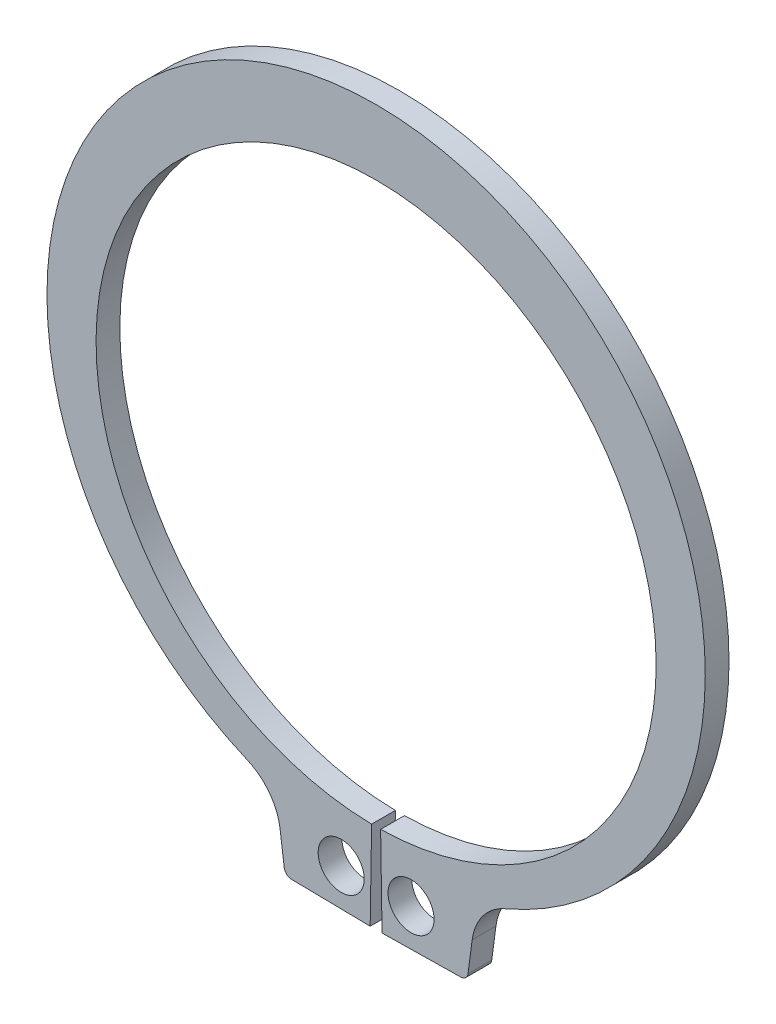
ISO-10303-21;
HEADER;
FILE_DESCRIPTION(('STEP AP214'),'2;1');
FILE_NAME('part.step','',(''),(''),'','','');
FILE_SCHEMA(('AUTOMOTIVE_DESIGN { 1 0 10303 214 1 1 1 1 }'));
ENDSEC;
DATA;
#1=APPLICATION_CONTEXT('core data for automotive mechanical design processes');
#2=APPLICATION_PROTOCOL_DEFINITION('international standard','automotive_design',2000,#1);
#3=PRODUCT_CONTEXT('',#1,'mechanical');
#4=PRODUCT('Part','Part','',(#3));
#5=PRODUCT_RELATED_PRODUCT_CATEGORY('part','',(#4));
#6=PRODUCT_DEFINITION_FORMATION('','',#4);
#7=PRODUCT_DEFINITION_CONTEXT('part definition',#1,'design');
#8=PRODUCT_DEFINITION('design','',#6,#7);
#9=PRODUCT_DEFINITION_SHAPE('','',#8);
#10=(LENGTH_UNIT() NAMED_UNIT(*) SI_UNIT(.MILLI.,.METRE.));
#11=(NAMED_UNIT(*) PLANE_ANGLE_UNIT() SI_UNIT($,.RADIAN.));
#12=(NAMED_UNIT(*) SI_UNIT($,.STERADIAN.) SOLID_ANGLE_UNIT());
#13=UNCERTAINTY_MEASURE_WITH_UNIT(LENGTH_MEASURE(1.E-05),#10,'distance_accuracy_value','');
#14=(GEOMETRIC_REPRESENTATION_CONTEXT(3) GLOBAL_UNCERTAINTY_ASSIGNED_CONTEXT((#13)) GLOBAL_UNIT_ASSIGNED_CONTEXT((#10,
#11,#12)) REPRESENTATION_CONTEXT('',''));
#15=CARTESIAN_POINT('',(0.,0.,0.));
#16=DIRECTION('',(0.,0.,1.));
#17=DIRECTION('',(1.,0.,0.));
#18=AXIS2_PLACEMENT_3D('',#15,#16,#17);
#19=CARTESIAN_POINT('',(0.,0.,-0.8));
#20=DIRECTION('',(0.,0.,1.));
#21=DIRECTION('',(1.,0.,0.));
#22=AXIS2_PLACEMENT_3D('',#19,#20,#21);
#23=CYLINDRICAL_SURFACE('',#22,18.85);
#24=CARTESIAN_POINT('',(0.,0.,0.8));
#25=DIRECTION('',(0.,0.,-1.));
#26=DIRECTION('',(1.,0.,0.));
#27=AXIS2_PLACEMENT_3D('',#24,#25,#26);
#28=CIRCLE('',#27,18.85);
#29=CARTESIAN_POINT('',(-0.303420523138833,-18.8475578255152,0.8));
#30=VERTEX_POINT('',#29);
#31=CARTESIAN_POINT('',(0.303420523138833,-18.8475578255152,0.8));
#32=VERTEX_POINT('',#31);
#33=EDGE_CURVE('E116',#30,#32,#28,.T.);
#34=ORIENTED_EDGE('',*,*,#33,.F.);
#35=DIRECTION('',(0.,0.,1.));
#36=VECTOR('',#35,1.);
#37=CARTESIAN_POINT('',(-0.303420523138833,-18.8475578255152,-0.8));
#38=LINE('',#37,#36);
#39=CARTESIAN_POINT('',(-0.303420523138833,-18.8475578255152,-0.8));
#40=VERTEX_POINT('',#39);
#41=EDGE_CURVE('E11',#40,#30,#38,.T.);
#42=ORIENTED_EDGE('',*,*,#41,.F.);
#43=CARTESIAN_POINT('',(0.,0.,-0.8));
#44=DIRECTION('',(0.,0.,-1.));
#45=DIRECTION('',(1.,0.,0.));
#46=AXIS2_PLACEMENT_3D('',#43,#44,#45);
#47=CIRCLE('',#46,18.85);
#48=CARTESIAN_POINT('',(0.303420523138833,-18.8475578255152,-0.8));
#49=VERTEX_POINT('',#48);
#50=EDGE_CURVE('E118',#40,#49,#47,.T.);
#51=ORIENTED_EDGE('',*,*,#50,.T.);
#52=DIRECTION('',(0.,0.,1.));
#53=VECTOR('',#52,1.);
#54=CARTESIAN_POINT('',(0.303420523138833,-18.8475578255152,-0.8));
#55=LINE('',#54,#53);
#56=EDGE_CURVE('E31',#49,#32,#55,.T.);
#57=ORIENTED_EDGE('',*,*,#56,.T.);
#58=EDGE_LOOP('',(#34,#42,#51,#57));
#59=FACE_BOUND('',#58,.T.);
#60=ADVANCED_FACE('F28',(#59),#23,.F.);
#61=CARTESIAN_POINT('',(-0.303420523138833,-18.8475578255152,-0.8));
#62=DIRECTION('',(0.999870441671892,-0.0160965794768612,0.));
#63=DIRECTION('',(0.0160965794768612,0.999870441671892,0.));
#64=AXIS2_PLACEMENT_3D('',#61,#62,#63);
#65=PLANE('',#64);
#66=DIRECTION('',(0.0160965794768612,0.999870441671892,0.));
#67=VECTOR('',#66,1.);
#68=CARTESIAN_POINT('',(-0.303420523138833,-18.8475578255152,0.8));
#69=LINE('',#68,#67);
#70=CARTESIAN_POINT('',(-0.4,-24.8467804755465,0.8));
#71=VERTEX_POINT('',#70);
#72=EDGE_CURVE('E134',#71,#30,#69,.T.);
#73=ORIENTED_EDGE('',*,*,#72,.F.);
#74=DIRECTION('',(0.,0.,1.));
#75=VECTOR('',#74,1.);
#76=CARTESIAN_POINT('',(-0.4,-24.8467804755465,-0.8));
#77=LINE('',#76,#75);
#78=CARTESIAN_POINT('',(-0.4,-24.8467804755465,-0.8));
#79=VERTEX_POINT('',#78);
#80=EDGE_CURVE('E36',#79,#71,#77,.T.);
#81=ORIENTED_EDGE('',*,*,#80,.F.);
#82=DIRECTION('',(0.0160965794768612,0.999870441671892,0.));
#83=VECTOR('',#82,1.);
#84=CARTESIAN_POINT('',(-0.303420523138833,-18.8475578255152,-0.8));
#85=LINE('',#84,#83);
#86=EDGE_CURVE('E123',#79,#40,#85,.T.);
#87=ORIENTED_EDGE('',*,*,#86,.T.);
#88=ORIENTED_EDGE('',*,*,#41,.T.);
#89=EDGE_LOOP('',(#73,#81,#87,#88));
#90=FACE_BOUND('',#89,.T.);
#91=ADVANCED_FACE('F246',(#90),#65,.T.);
#92=CARTESIAN_POINT('',(-0.4,-24.8467804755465,-0.8));
#93=DIRECTION('',(-0.0160965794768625,-0.999870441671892,0.));
#94=DIRECTION('',(0.999870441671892,-0.0160965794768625,0.));
#95=AXIS2_PLACEMENT_3D('',#92,#93,#94);
#96=PLANE('',#95);
#97=DIRECTION('',(0.999870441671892,-0.0160965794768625,0.));
#98=VECTOR('',#97,1.);
#99=CARTESIAN_POINT('',(-0.4,-24.8467804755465,0.8));
#100=LINE('',#99,#98);
#101=CARTESIAN_POINT('',(-5.69728426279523,-24.7615012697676,0.8));
#102=VERTEX_POINT('',#101);
#103=EDGE_CURVE('E164',#102,#71,#100,.T.);
#104=ORIENTED_EDGE('',*,*,#103,.F.);
#105=DIRECTION('',(0.,0.,1.));
#106=VECTOR('',#105,1.);
#107=CARTESIAN_POINT('',(-5.69728426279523,-24.7615012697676,-0.8));
#108=LINE('',#107,#106);
#109=CARTESIAN_POINT('',(-5.69728426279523,-24.7615012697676,-0.8));
#110=VERTEX_POINT('',#109);
#111=EDGE_CURVE('E198',#110,#102,#108,.T.);
#112=ORIENTED_EDGE('',*,*,#111,.F.);
#113=DIRECTION('',(0.999870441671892,-0.0160965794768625,0.));
#114=VECTOR('',#113,1.);
#115=CARTESIAN_POINT('',(-0.4,-24.8467804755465,-0.8));
#116=LINE('',#115,#114);
#117=EDGE_CURVE('E194',#110,#79,#116,.T.);
#118=ORIENTED_EDGE('',*,*,#117,.T.);
#119=ORIENTED_EDGE('',*,*,#80,.T.);
#120=EDGE_LOOP('',(#104,#112,#118,#119));
#121=FACE_BOUND('',#120,.T.);
#122=ADVANCED_FACE('F251',(#121),#96,.T.);
#123=CARTESIAN_POINT('',(-5.6892359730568,-24.2615660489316,-0.8));
#124=DIRECTION('',(0.,0.,1.));
#125=DIRECTION('',(1.,0.,0.));
#126=AXIS2_PLACEMENT_3D('',#123,#124,#125);
#127=CYLINDRICAL_SURFACE('',#126,0.499999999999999);
#128=CARTESIAN_POINT('',(-5.6892359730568,-24.2615660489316,0.8));
#129=DIRECTION('',(0.,0.,1.));
#130=DIRECTION('',(1.,0.,0.));
#131=AXIS2_PLACEMENT_3D('',#128,#129,#130);
#132=CIRCLE('',#131,0.499999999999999);
#133=CARTESIAN_POINT('',(-6.1849584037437,-24.3268291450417,0.8));
#134=VERTEX_POINT('',#133);
#135=EDGE_CURVE('E161',#134,#102,#132,.T.);
#136=ORIENTED_EDGE('',*,*,#135,.F.);
#137=DIRECTION('',(0.,0.,1.));
#138=VECTOR('',#137,1.);
#139=CARTESIAN_POINT('',(-6.1849584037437,-24.3268291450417,-0.8));
#140=LINE('',#139,#138);
#141=CARTESIAN_POINT('',(-6.1849584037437,-24.3268291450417,-0.8));
#142=VERTEX_POINT('',#141);
#143=EDGE_CURVE('E200',#142,#134,#140,.T.);
#144=ORIENTED_EDGE('',*,*,#143,.F.);
#145=CARTESIAN_POINT('',(-5.6892359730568,-24.2615660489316,-0.8));
#146=DIRECTION('',(0.,0.,1.));
#147=DIRECTION('',(1.,0.,0.));
#148=AXIS2_PLACEMENT_3D('',#145,#146,#147);
#149=CIRCLE('',#148,0.499999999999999);
#150=EDGE_CURVE('E191',#142,#110,#149,.T.);
#151=ORIENTED_EDGE('',*,*,#150,.T.);
#152=ORIENTED_EDGE('',*,*,#111,.T.);
#153=EDGE_LOOP('',(#136,#144,#151,#152));
#154=FACE_BOUND('',#153,.T.);
#155=ADVANCED_FACE('F243',(#154),#127,.T.);
#156=CARTESIAN_POINT('',(-6.46391487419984,-22.2079443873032,-0.8));
#157=DIRECTION('',(-0.99144486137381,-0.130526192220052,0.));
#158=DIRECTION('',(0.130526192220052,-0.99144486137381,0.));
#159=AXIS2_PLACEMENT_3D('',#156,#157,#158);
#160=PLANE('',#159);
#161=DIRECTION('',(0.130526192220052,-0.99144486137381,0.));
#162=VECTOR('',#161,1.);
#163=CARTESIAN_POINT('',(-6.46391487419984,-22.2079443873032,0.8));
#164=LINE('',#163,#162);
#165=CARTESIAN_POINT('',(-6.46391487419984,-22.2079443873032,0.8));
#166=VERTEX_POINT('',#165);
#167=EDGE_CURVE('E158',#166,#134,#164,.T.);
#168=ORIENTED_EDGE('',*,*,#167,.F.);
#169=DIRECTION('',(0.,0.,1.));
#170=VECTOR('',#169,1.);
#171=CARTESIAN_POINT('',(-6.46391487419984,-22.2079443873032,-0.8));
#172=LINE('',#171,#170);
#173=CARTESIAN_POINT('',(-6.46391487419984,-22.2079443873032,-0.8));
#174=VERTEX_POINT('',#173);
#175=EDGE_CURVE('E202',#174,#166,#172,.T.);
#176=ORIENTED_EDGE('',*,*,#175,.F.);
#177=DIRECTION('',(0.130526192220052,-0.99144486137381,0.));
#178=VECTOR('',#177,1.);
#179=CARTESIAN_POINT('',(-6.46391487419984,-22.2079443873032,-0.8));
#180=LINE('',#179,#178);
#181=EDGE_CURVE('E188',#174,#142,#180,.T.);
#182=ORIENTED_EDGE('',*,*,#181,.T.);
#183=ORIENTED_EDGE('',*,*,#143,.T.);
#184=EDGE_LOOP('',(#168,#176,#182,#183));
#185=FACE_BOUND('',#184,.T.);
#186=ADVANCED_FACE('F239',(#185),#160,.T.);
#187=CARTESIAN_POINT('',(-10.1316221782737,-22.690807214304,-0.8));
#188=DIRECTION('',(0.,0.,1.));
#189=DIRECTION('',(1.,0.,0.));
#190=AXIS2_PLACEMENT_3D('',#187,#188,#189);
#191=CYLINDRICAL_SURFACE('',#190,3.69935580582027);
#192=CARTESIAN_POINT('',(-10.1316221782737,-22.690807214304,0.8));
#193=DIRECTION('',(0.,0.,-1.));
#194=DIRECTION('',(1.,0.,0.));
#195=AXIS2_PLACEMENT_3D('',#192,#193,#194);
#196=CIRCLE('',#195,3.69935580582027);
#197=CARTESIAN_POINT('',(-8.68192595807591,-19.2873363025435,0.8));
#198=VERTEX_POINT('',#197);
#199=EDGE_CURVE('E155',#198,#166,#196,.T.);
#200=ORIENTED_EDGE('',*,*,#199,.F.);
#201=DIRECTION('',(0.,0.,1.));
#202=VECTOR('',#201,1.);
#203=CARTESIAN_POINT('',(-8.68192595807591,-19.2873363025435,-0.8));
#204=LINE('',#203,#202);
#205=CARTESIAN_POINT('',(-8.68192595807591,-19.2873363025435,-0.8));
#206=VERTEX_POINT('',#205);
#207=EDGE_CURVE('E204',#206,#198,#204,.T.);
#208=ORIENTED_EDGE('',*,*,#207,.F.);
#209=CARTESIAN_POINT('',(-10.1316221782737,-22.690807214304,-0.8));
#210=DIRECTION('',(0.,0.,-1.));
#211=DIRECTION('',(1.,0.,0.));
#212=AXIS2_PLACEMENT_3D('',#209,#210,#211);
#213=CIRCLE('',#212,3.69935580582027);
#214=EDGE_CURVE('E185',#206,#174,#213,.T.);
#215=ORIENTED_EDGE('',*,*,#214,.T.);
#216=ORIENTED_EDGE('',*,*,#175,.T.);
#217=EDGE_LOOP('',(#200,#208,#215,#216));
#218=FACE_BOUND('',#217,.T.);
#219=ADVANCED_FACE('F235',(#218),#191,.F.);
#220=CARTESIAN_POINT('',(0.,1.09533562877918,-0.8));
#221=DIRECTION('',(0.,0.,1.));
#222=DIRECTION('',(1.,0.,0.));
#223=AXIS2_PLACEMENT_3D('',#220,#221,#222);
#224=CYLINDRICAL_SURFACE('',#223,22.1546643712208);
#225=CARTESIAN_POINT('',(0.,1.09533562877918,0.8));
#226=DIRECTION('',(0.,0.,1.));
#227=DIRECTION('',(1.,0.,0.));
#228=AXIS2_PLACEMENT_3D('',#225,#226,#227);
#229=CIRCLE('',#228,22.1546643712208);
#230=CARTESIAN_POINT('',(8.6819259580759,-19.2873363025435,0.8));
#231=VERTEX_POINT('',#230);
#232=EDGE_CURVE('E152',#231,#198,#229,.T.);
#233=ORIENTED_EDGE('',*,*,#232,.F.);
#234=DIRECTION('',(0.,0.,1.));
#235=VECTOR('',#234,1.);
#236=CARTESIAN_POINT('',(8.6819259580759,-19.2873363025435,-0.8));
#237=LINE('',#236,#235);
#238=CARTESIAN_POINT('',(8.6819259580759,-19.2873363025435,-0.8));
#239=VERTEX_POINT('',#238);
#240=EDGE_CURVE('E206',#239,#231,#237,.T.);
#241=ORIENTED_EDGE('',*,*,#240,.F.);
#242=CARTESIAN_POINT('',(0.,1.09533562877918,-0.8));
#243=DIRECTION('',(0.,0.,1.));
#244=DIRECTION('',(1.,0.,0.));
#245=AXIS2_PLACEMENT_3D('',#242,#243,#244);
#246=CIRCLE('',#245,22.1546643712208);
#247=EDGE_CURVE('E182',#239,#206,#246,.T.);
#248=ORIENTED_EDGE('',*,*,#247,.T.);
#249=ORIENTED_EDGE('',*,*,#207,.T.);
#250=EDGE_LOOP('',(#233,#241,#248,#249));
#251=FACE_BOUND('',#250,.T.);
#252=ADVANCED_FACE('F231',(#251),#224,.T.);
#253=CARTESIAN_POINT('',(10.1316221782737,-22.690807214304,-0.8));
#254=DIRECTION('',(0.,0.,1.));
#255=DIRECTION('',(1.,0.,0.));
#256=AXIS2_PLACEMENT_3D('',#253,#254,#255);
#257=CYLINDRICAL_SURFACE('',#256,3.69935580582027);
#258=CARTESIAN_POINT('',(10.1316221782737,-22.690807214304,0.8));
#259=DIRECTION('',(0.,0.,-1.));
#260=DIRECTION('',(1.,0.,0.));
#261=AXIS2_PLACEMENT_3D('',#258,#259,#260);
#262=CIRCLE('',#261,3.69935580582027);
#263=CARTESIAN_POINT('',(6.46391487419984,-22.2079443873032,0.8));
#264=VERTEX_POINT('',#263);
#265=EDGE_CURVE('E149',#264,#231,#262,.T.);
#266=ORIENTED_EDGE('',*,*,#265,.F.);
#267=DIRECTION('',(0.,0.,1.));
#268=VECTOR('',#267,1.);
#269=CARTESIAN_POINT('',(6.46391487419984,-22.2079443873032,-0.8));
#270=LINE('',#269,#268);
#271=CARTESIAN_POINT('',(6.46391487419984,-22.2079443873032,-0.8));
#272=VERTEX_POINT('',#271);
#273=EDGE_CURVE('E208',#272,#264,#270,.T.);
#274=ORIENTED_EDGE('',*,*,#273,.F.);
#275=CARTESIAN_POINT('',(10.1316221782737,-22.690807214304,-0.8));
#276=DIRECTION('',(0.,0.,-1.));
#277=DIRECTION('',(1.,0.,0.));
#278=AXIS2_PLACEMENT_3D('',#275,#276,#277);
#279=CIRCLE('',#278,3.69935580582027);
#280=EDGE_CURVE('E179',#272,#239,#279,.T.);
#281=ORIENTED_EDGE('',*,*,#280,.T.);
#282=ORIENTED_EDGE('',*,*,#240,.T.);
#283=EDGE_LOOP('',(#266,#274,#281,#282));
#284=FACE_BOUND('',#283,.T.);
#285=ADVANCED_FACE('F227',(#284),#257,.F.);
#286=CARTESIAN_POINT('',(6.46391487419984,-22.2079443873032,-0.8));
#287=DIRECTION('',(0.99144486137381,-0.130526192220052,0.));
#288=DIRECTION('',(0.130526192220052,0.99144486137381,0.));
#289=AXIS2_PLACEMENT_3D('',#286,#287,#288);
#290=PLANE('',#289);
#291=DIRECTION('',(0.130526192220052,0.99144486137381,0.));
#292=VECTOR('',#291,1.);
#293=CARTESIAN_POINT('',(6.46391487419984,-22.2079443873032,0.8));
#294=LINE('',#293,#292);
#295=CARTESIAN_POINT('',(6.1849584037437,-24.3268291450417,0.8));
#296=VERTEX_POINT('',#295);
#297=EDGE_CURVE('E146',#296,#264,#294,.T.);
#298=ORIENTED_EDGE('',*,*,#297,.F.);
#299=DIRECTION('',(0.,0.,1.));
#300=VECTOR('',#299,1.);
#301=CARTESIAN_POINT('',(6.1849584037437,-24.3268291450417,-0.8));
#302=LINE('',#301,#300);
#303=CARTESIAN_POINT('',(6.1849584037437,-24.3268291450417,-0.8));
#304=VERTEX_POINT('',#303);
#305=EDGE_CURVE('E210',#304,#296,#302,.T.);
#306=ORIENTED_EDGE('',*,*,#305,.F.);
#307=DIRECTION('',(0.130526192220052,0.99144486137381,0.));
#308=VECTOR('',#307,1.);
#309=CARTESIAN_POINT('',(6.46391487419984,-22.2079443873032,-0.8));
#310=LINE('',#309,#308);
#311=EDGE_CURVE('E176',#304,#272,#310,.T.);
#312=ORIENTED_EDGE('',*,*,#311,.T.);
#313=ORIENTED_EDGE('',*,*,#273,.T.);
#314=EDGE_LOOP('',(#298,#306,#312,#313));
#315=FACE_BOUND('',#314,.T.);
#316=ADVANCED_FACE('F223',(#315),#290,.T.);
#317=CARTESIAN_POINT('',(5.6892359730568,-24.2615660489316,-0.8));
#318=DIRECTION('',(0.,0.,1.));
#319=DIRECTION('',(1.,0.,0.));
#320=AXIS2_PLACEMENT_3D('',#317,#318,#319);
#321=CYLINDRICAL_SURFACE('',#320,0.499999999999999);
#322=CARTESIAN_POINT('',(5.6892359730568,-24.2615660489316,0.8));
#323=DIRECTION('',(0.,0.,1.));
#324=DIRECTION('',(-1.,0.,0.));
#325=AXIS2_PLACEMENT_3D('',#322,#323,#324);
#326=CIRCLE('',#325,0.499999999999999);
#327=CARTESIAN_POINT('',(5.69728426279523,-24.7615012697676,0.8));
#328=VERTEX_POINT('',#327);
#329=EDGE_CURVE('E143',#328,#296,#326,.T.);
#330=ORIENTED_EDGE('',*,*,#329,.F.);
#331=DIRECTION('',(0.,0.,1.));
#332=VECTOR('',#331,1.);
#333=CARTESIAN_POINT('',(5.69728426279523,-24.7615012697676,-0.8));
#334=LINE('',#333,#332);
#335=CARTESIAN_POINT('',(5.69728426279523,-24.7615012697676,-0.8));
#336=VERTEX_POINT('',#335);
#337=EDGE_CURVE('E212',#336,#328,#334,.T.);
#338=ORIENTED_EDGE('',*,*,#337,.F.);
#339=CARTESIAN_POINT('',(5.6892359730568,-24.2615660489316,-0.8));
#340=DIRECTION('',(0.,0.,1.));
#341=DIRECTION('',(-1.,0.,0.));
#342=AXIS2_PLACEMENT_3D('',#339,#340,#341);
#343=CIRCLE('',#342,0.499999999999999);
#344=EDGE_CURVE('E173',#336,#304,#343,.T.);
#345=ORIENTED_EDGE('',*,*,#344,.T.);
#346=ORIENTED_EDGE('',*,*,#305,.T.);
#347=EDGE_LOOP('',(#330,#338,#345,#346));
#348=FACE_BOUND('',#347,.T.);
#349=ADVANCED_FACE('F219',(#348),#321,.T.);
#350=CARTESIAN_POINT('',(0.4,-24.8467804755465,-0.8));
#351=DIRECTION('',(0.0160965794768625,-0.999870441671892,0.));
#352=DIRECTION('',(0.999870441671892,0.0160965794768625,0.));
#353=AXIS2_PLACEMENT_3D('',#350,#351,#352);
#354=PLANE('',#353);
#355=DIRECTION('',(0.999870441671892,0.0160965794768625,0.));
#356=VECTOR('',#355,1.);
#357=CARTESIAN_POINT('',(0.4,-24.8467804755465,0.8));
#358=LINE('',#357,#356);
#359=CARTESIAN_POINT('',(0.4,-24.8467804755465,0.8));
#360=VERTEX_POINT('',#359);
#361=EDGE_CURVE('E130',#360,#328,#358,.T.);
#362=ORIENTED_EDGE('',*,*,#361,.F.);
#363=DIRECTION('',(0.,0.,1.));
#364=VECTOR('',#363,1.);
#365=CARTESIAN_POINT('',(0.4,-24.8467804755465,-0.8));
#366=LINE('',#365,#364);
#367=CARTESIAN_POINT('',(0.4,-24.8467804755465,-0.8));
#368=VERTEX_POINT('',#367);
#369=EDGE_CURVE('E122',#368,#360,#366,.T.);
#370=ORIENTED_EDGE('',*,*,#369,.F.);
#371=DIRECTION('',(0.999870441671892,0.0160965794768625,0.));
#372=VECTOR('',#371,1.);
#373=CARTESIAN_POINT('',(0.4,-24.8467804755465,-0.8));
#374=LINE('',#373,#372);
#375=EDGE_CURVE('E170',#368,#336,#374,.T.);
#376=ORIENTED_EDGE('',*,*,#375,.T.);
#377=ORIENTED_EDGE('',*,*,#337,.T.);
#378=EDGE_LOOP('',(#362,#370,#376,#377));
#379=FACE_BOUND('',#378,.T.);
#380=ADVANCED_FACE('F215',(#379),#354,.T.);
#381=CARTESIAN_POINT('',(0.303420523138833,-18.8475578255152,-0.8));
#382=DIRECTION('',(-0.999870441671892,-0.0160965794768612,0.));
#383=DIRECTION('',(0.0160965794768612,-0.999870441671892,0.));
#384=AXIS2_PLACEMENT_3D('',#381,#382,#383);
#385=PLANE('',#384);
#386=DIRECTION('',(0.0160965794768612,-0.999870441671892,0.));
#387=VECTOR('',#386,1.);
#388=CARTESIAN_POINT('',(0.303420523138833,-18.8475578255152,0.8));
#389=LINE('',#388,#387);
#390=EDGE_CURVE('E125',#32,#360,#389,.T.);
#391=ORIENTED_EDGE('',*,*,#390,.F.);
#392=ORIENTED_EDGE('',*,*,#56,.F.);
#393=DIRECTION('',(0.0160965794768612,-0.999870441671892,0.));
#394=VECTOR('',#393,1.);
#395=CARTESIAN_POINT('',(0.303420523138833,-18.8475578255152,-0.8));
#396=LINE('',#395,#394);
#397=EDGE_CURVE('E168',#49,#368,#396,.T.);
#398=ORIENTED_EDGE('',*,*,#397,.T.);
#399=ORIENTED_EDGE('',*,*,#369,.T.);
#400=EDGE_LOOP('',(#391,#392,#398,#399));
#401=FACE_BOUND('',#400,.T.);
#402=ADVANCED_FACE('F126',(#401),#385,.T.);
#403=CARTESIAN_POINT('',(0.,0.,-0.8));
#404=DIRECTION('',(0.,0.,1.));
#405=DIRECTION('',(1.,0.,0.));
#406=AXIS2_PLACEMENT_3D('',#403,#404,#405);
#407=PLANE('',#406);
#408=CARTESIAN_POINT('',(-2.35,-22.3015274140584,-0.8));
#409=DIRECTION('',(0.,0.,1.));
#410=DIRECTION('',(1.,0.,0.));
#411=AXIS2_PLACEMENT_3D('',#408,#409,#410);
#412=CIRCLE('',#411,1.55);
#413=CARTESIAN_POINT('',(-0.8,-22.3015274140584,-0.8));
#414=VERTEX_POINT('',#413);
#415=EDGE_CURVE('E355',#414,#414,#412,.T.);
#416=ORIENTED_EDGE('',*,*,#415,.T.);
#417=EDGE_LOOP('',(#416));
#418=FACE_BOUND('',#417,.T.);
#419=CARTESIAN_POINT('',(2.35,-22.3015274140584,-0.8));
#420=DIRECTION('',(0.,0.,1.));
#421=DIRECTION('',(1.,0.,0.));
#422=AXIS2_PLACEMENT_3D('',#419,#420,#421);
#423=CIRCLE('',#422,1.55);
#424=CARTESIAN_POINT('',(3.9,-22.3015274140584,-0.8));
#425=VERTEX_POINT('',#424);
#426=EDGE_CURVE('E135',#425,#425,#423,.T.);
#427=ORIENTED_EDGE('',*,*,#426,.T.);
#428=EDGE_LOOP('',(#427));
#429=FACE_BOUND('',#428,.T.);
#430=ORIENTED_EDGE('',*,*,#50,.F.);
#431=ORIENTED_EDGE('',*,*,#86,.F.);
#432=ORIENTED_EDGE('',*,*,#117,.F.);
#433=ORIENTED_EDGE('',*,*,#150,.F.);
#434=ORIENTED_EDGE('',*,*,#181,.F.);
#435=ORIENTED_EDGE('',*,*,#214,.F.);
#436=ORIENTED_EDGE('',*,*,#247,.F.);
#437=ORIENTED_EDGE('',*,*,#280,.F.);
#438=ORIENTED_EDGE('',*,*,#311,.F.);
#439=ORIENTED_EDGE('',*,*,#344,.F.);
#440=ORIENTED_EDGE('',*,*,#375,.F.);
#441=ORIENTED_EDGE('',*,*,#397,.F.);
#442=EDGE_LOOP('',(#430,#431,#432,#433,#434,#435,#436,#437,#438,#439,#440,#441));
#443=FACE_BOUND('',#442,.T.);
#444=ADVANCED_FACE('F250',(#418,#429,#443),#407,.F.);
#445=CARTESIAN_POINT('',(0.,0.,0.8));
#446=DIRECTION('',(0.,0.,1.));
#447=DIRECTION('',(1.,0.,0.));
#448=AXIS2_PLACEMENT_3D('',#445,#446,#447);
#449=PLANE('',#448);
#450=CARTESIAN_POINT('',(-2.35,-22.3015274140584,0.8));
#451=DIRECTION('',(0.,0.,1.));
#452=DIRECTION('',(1.,0.,0.));
#453=AXIS2_PLACEMENT_3D('',#450,#451,#452);
#454=CIRCLE('',#453,1.55);
#455=CARTESIAN_POINT('',(-0.8,-22.3015274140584,0.8));
#456=VERTEX_POINT('',#455);
#457=EDGE_CURVE('E358',#456,#456,#454,.T.);
#458=ORIENTED_EDGE('',*,*,#457,.F.);
#459=EDGE_LOOP('',(#458));
#460=FACE_BOUND('',#459,.T.);
#461=CARTESIAN_POINT('',(2.35,-22.3015274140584,0.8));
#462=DIRECTION('',(0.,0.,1.));
#463=DIRECTION('',(1.,0.,0.));
#464=AXIS2_PLACEMENT_3D('',#461,#462,#463);
#465=CIRCLE('',#464,1.55);
#466=CARTESIAN_POINT('',(3.9,-22.3015274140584,0.8));
#467=VERTEX_POINT('',#466);
#468=EDGE_CURVE('E138',#467,#467,#465,.T.);
#469=ORIENTED_EDGE('',*,*,#468,.F.);
#470=EDGE_LOOP('',(#469));
#471=FACE_BOUND('',#470,.T.);
#472=ORIENTED_EDGE('',*,*,#33,.T.);
#473=ORIENTED_EDGE('',*,*,#390,.T.);
#474=ORIENTED_EDGE('',*,*,#361,.T.);
#475=ORIENTED_EDGE('',*,*,#329,.T.);
#476=ORIENTED_EDGE('',*,*,#297,.T.);
#477=ORIENTED_EDGE('',*,*,#265,.T.);
#478=ORIENTED_EDGE('',*,*,#232,.T.);
#479=ORIENTED_EDGE('',*,*,#199,.T.);
#480=ORIENTED_EDGE('',*,*,#167,.T.);
#481=ORIENTED_EDGE('',*,*,#135,.T.);
#482=ORIENTED_EDGE('',*,*,#103,.T.);
#483=ORIENTED_EDGE('',*,*,#72,.T.);
#484=EDGE_LOOP('',(#472,#473,#474,#475,#476,#477,#478,#479,#480,#481,#482,#483));
#485=FACE_BOUND('',#484,.T.);
#486=ADVANCED_FACE('F132',(#460,#471,#485),#449,.T.);
#487=CARTESIAN_POINT('',(2.35,-22.3015274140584,-0.8));
#488=DIRECTION('',(0.,0.,1.));
#489=DIRECTION('',(1.,0.,0.));
#490=AXIS2_PLACEMENT_3D('',#487,#488,#489);
#491=CYLINDRICAL_SURFACE('',#490,1.55);
#492=ORIENTED_EDGE('',*,*,#426,.F.);
#493=EDGE_LOOP('',(#492));
#494=FACE_BOUND('',#493,.T.);
#495=ORIENTED_EDGE('',*,*,#468,.T.);
#496=EDGE_LOOP('',(#495));
#497=FACE_BOUND('',#496,.T.);
#498=ADVANCED_FACE('F334',(#494,#497),#491,.F.);
#499=CARTESIAN_POINT('',(-2.35,-22.3015274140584,-0.8));
#500=DIRECTION('',(0.,0.,1.));
#501=DIRECTION('',(1.,0.,0.));
#502=AXIS2_PLACEMENT_3D('',#499,#500,#501);
#503=CYLINDRICAL_SURFACE('',#502,1.55);
#504=ORIENTED_EDGE('',*,*,#415,.F.);
#505=EDGE_LOOP('',(#504));
#506=FACE_BOUND('',#505,.T.);
#507=ORIENTED_EDGE('',*,*,#457,.T.);
#508=EDGE_LOOP('',(#507));
#509=FACE_BOUND('',#508,.T.);
#510=ADVANCED_FACE('F342',(#506,#509),#503,.F.);
#511=CLOSED_SHELL('',(#60,#91,#122,#155,#186,#219,#252,#285,#316,#349,#380,#402,#444,#486,#498,#510));
#512=MANIFOLD_SOLID_BREP('B2',#511);
#513=ADVANCED_BREP_SHAPE_REPRESENTATION('',(#18,#512),#14);
#514=SHAPE_DEFINITION_REPRESENTATION(#9,#513);
ENDSEC;
END-ISO-10303-21;
